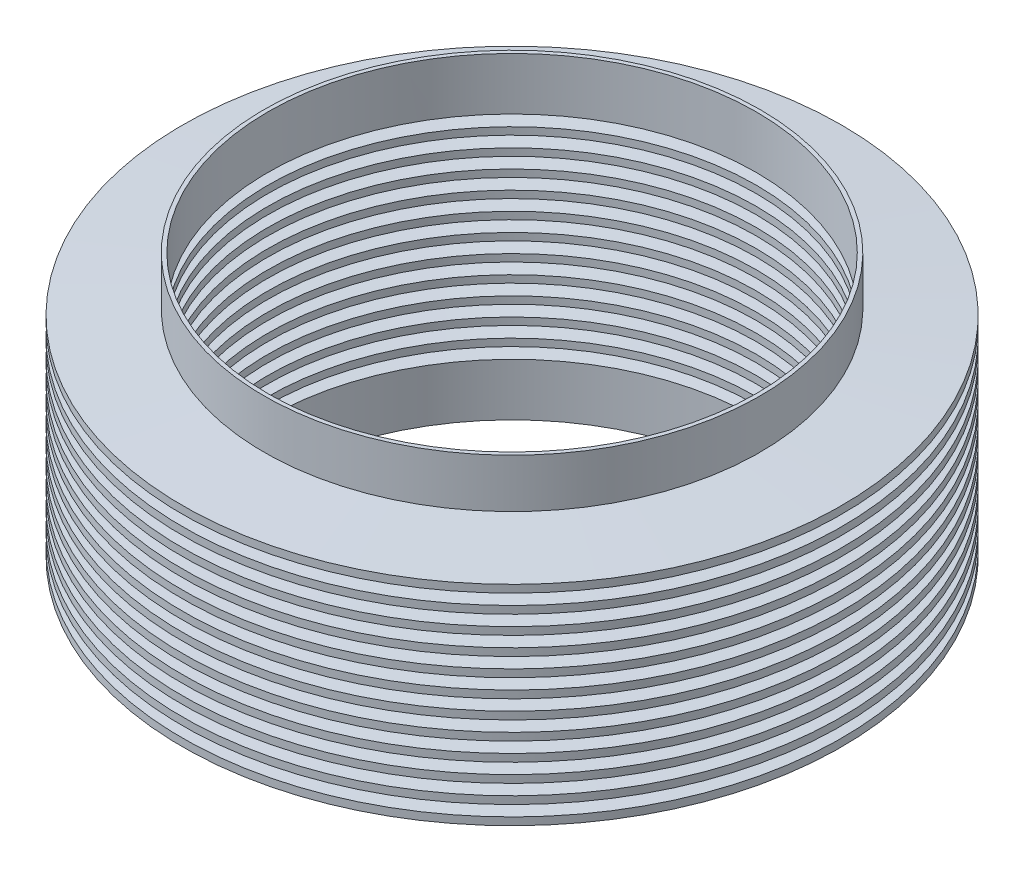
from build123d import *

# Parameters (mm, degrees)
SKETCH11_W = 64.516
SKETCH11_H = 12.7


with BuildPart() as part:
    # Sketch1 → Revolve1 (revolve)
    with BuildSketch(Plane.XY, mode=Mode.PRIVATE) as revolve1_sk:
        Polygon((-64.516, 0), (-63.5, 0), (-63.5, 26.351564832), (-85.304718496, 27.78125), (-63.5, 29.210935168), (-63.5, 31.114064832), (-85.304718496, 32.54375), (-63.5, 33.973435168), (-63.5, 35.876564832), (-85.304718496, 37.30625), (-63.5, 38.735935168), (-63.5, 40.639064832), (-85.304718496, 42.06875), (-63.5, 43.498435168), (-63.5, 45.401564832), (-85.304718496, 46.83125), (-63.5, 48.260935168), (-63.5, 50.164064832), (-85.304718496, 51.59375), (-63.5, 53.023435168), (-63.5, 54.926564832), (-85.304718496, 56.35625), (-63.5, 57.785935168), (-63.5, 59.689064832), (-85.304718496, 61.11875), (-63.5, 62.548435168), (-63.5, 64.451564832), (-85.304718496, 65.88125), (-63.5, 67.310935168), (-63.5, 69.214064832), (-85.304718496, 70.64375), (-63.5, 72.073435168), (-63.5, 73.976564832), (-85.304718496, 75.40625), (-63.5, 76.835935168), (-63.5, 78.739064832), (-85.304718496, 80.16875), (-63.5, 81.598435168), (-63.5, 107.95), (-64.516, 107.95), (-64.516, 82.55), (-85.725, 81.159374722), (-85.725, 79.178125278), (-64.516, 77.7875), (-85.725, 76.396874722), (-85.725, 74.415625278), (-64.516, 73.025), (-85.725, 71.634374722), (-85.725, 69.653125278), (-64.516, 68.2625), (-85.725, 66.871874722), (-85.725, 64.890625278), (-64.516, 63.5), (-85.725, 62.109374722), (-85.725, 60.128125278), (-64.516, 58.7375), (-85.725, 57.346874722), (-85.725, 55.365625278), (-64.516, 53.975), (-85.725, 52.584374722), (-85.725, 50.603125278), (-64.516, 49.2125), (-85.725, 47.821874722), (-85.725, 45.840625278), (-64.516, 44.45), (-85.725, 43.059374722), (-85.725, 41.078125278), (-64.516, 39.6875), (-85.725, 38.296874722), (-85.725, 36.315625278), (-64.516, 34.925), (-85.725, 33.534374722), (-85.725, 31.553125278), (-64.516, 30.1625), (-85.725, 28.771874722), (-85.725, 26.790625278), (-64.516, 25.4), align=None)
    revolve(revolve1_sk.sketch.rotate(Axis((0, 0, 0), (0, 1, 0)), 270), axis=Axis((0, 0, 0), (0, 1, 0)))

    # Sketch11 → Cut-Revolve1 (revolve, cut)
    with BuildSketch(Plane.XY, mode=Mode.PRIVATE) as cut_revolve1_sk:
        with Locations((-32.258, 101.6)):
            Rectangle(SKETCH11_W, SKETCH11_H)
        with Locations((-32.258, 6.35)):
            Rectangle(SKETCH11_W, SKETCH11_H)
    revolve(cut_revolve1_sk.sketch.rotate(Axis((0, 4.14990993, 0), (0, 1, 0)), 270), axis=Axis((0, 4.14990993, 0), (0, 1, 0)), mode=Mode.SUBTRACT)


solid = part.part
